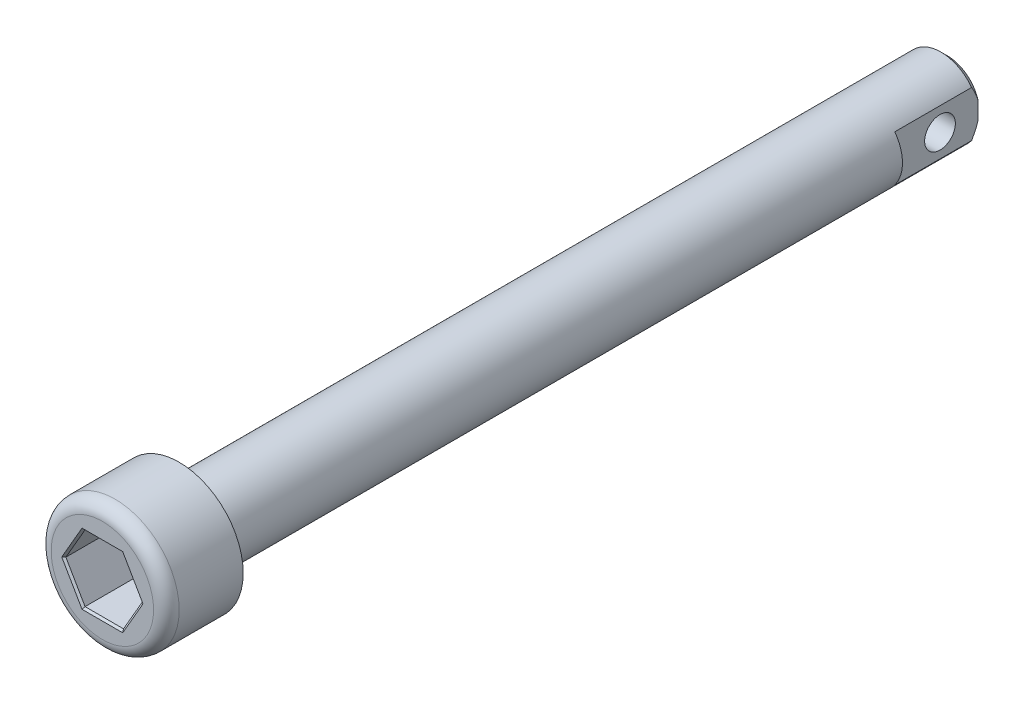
ISO-10303-21;
HEADER;
FILE_DESCRIPTION(('STEP AP214'),'2;1');
FILE_NAME('part.step','',(''),(''),'','','');
FILE_SCHEMA(('AUTOMOTIVE_DESIGN { 1 0 10303 214 1 1 1 1 }'));
ENDSEC;
DATA;
#1=APPLICATION_CONTEXT('core data for automotive mechanical design processes');
#2=APPLICATION_PROTOCOL_DEFINITION('international standard','automotive_design',2000,#1);
#3=PRODUCT_CONTEXT('',#1,'mechanical');
#4=PRODUCT('Part','Part','',(#3));
#5=PRODUCT_RELATED_PRODUCT_CATEGORY('part','',(#4));
#6=PRODUCT_DEFINITION_FORMATION('','',#4);
#7=PRODUCT_DEFINITION_CONTEXT('part definition',#1,'design');
#8=PRODUCT_DEFINITION('design','',#6,#7);
#9=PRODUCT_DEFINITION_SHAPE('','',#8);
#10=(LENGTH_UNIT() NAMED_UNIT(*) SI_UNIT(.MILLI.,.METRE.));
#11=(NAMED_UNIT(*) PLANE_ANGLE_UNIT() SI_UNIT($,.RADIAN.));
#12=(NAMED_UNIT(*) SI_UNIT($,.STERADIAN.) SOLID_ANGLE_UNIT());
#13=UNCERTAINTY_MEASURE_WITH_UNIT(LENGTH_MEASURE(1.E-05),#10,'distance_accuracy_value','');
#14=(GEOMETRIC_REPRESENTATION_CONTEXT(3) GLOBAL_UNCERTAINTY_ASSIGNED_CONTEXT((#13)) GLOBAL_UNIT_ASSIGNED_CONTEXT((#10,
#11,#12)) REPRESENTATION_CONTEXT('',''));
#15=CARTESIAN_POINT('',(0.,0.,0.));
#16=DIRECTION('',(0.,0.,1.));
#17=DIRECTION('',(1.,0.,0.));
#18=AXIS2_PLACEMENT_3D('',#15,#16,#17);
#19=CARTESIAN_POINT('',(0.,0.,-60.));
#20=DIRECTION('',(0.,0.,1.));
#21=DIRECTION('',(1.,0.,0.));
#22=AXIS2_PLACEMENT_3D('',#19,#20,#21);
#23=CONICAL_SURFACE('',#22,2.49999999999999,0.785398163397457);
#24=CARTESIAN_POINT('',(-2.4,-4.86411981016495,-57.0760105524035));
#25=CARTESIAN_POINT('',(-2.4,-4.75343904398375,-57.1752525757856));
#26=CARTESIAN_POINT('',(-2.4,-4.64244060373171,-57.2741434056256));
#27=CARTESIAN_POINT('',(-2.4,-4.41964149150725,-57.471036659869));
#28=CARTESIAN_POINT('',(-2.4,-4.30784074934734,-57.5690390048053));
#29=CARTESIAN_POINT('',(-2.4,-4.08288344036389,-57.7643042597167));
#30=CARTESIAN_POINT('',(-2.4,-3.96972343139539,-57.8615632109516));
#31=CARTESIAN_POINT('',(-2.4,-3.74223523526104,-58.0546982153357));
#32=CARTESIAN_POINT('',(-2.4,-3.6279070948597,-58.1505743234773));
#33=CARTESIAN_POINT('',(-2.4,-3.39101040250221,-58.346179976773));
#34=CARTESIAN_POINT('',(-2.4,-3.26835369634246,-58.4458030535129));
#35=CARTESIAN_POINT('',(-2.4,-3.02097816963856,-58.6424528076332));
#36=CARTESIAN_POINT('',(-2.4,-2.89625945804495,-58.739479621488));
#37=CARTESIAN_POINT('',(-2.4,-2.64434021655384,-58.9298829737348));
#38=CARTESIAN_POINT('',(-2.4,-2.51714357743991,-59.0232646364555));
#39=CARTESIAN_POINT('',(-2.4,-2.25931597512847,-59.205135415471));
#40=CARTESIAN_POINT('',(-2.4,-2.12868602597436,-59.2936259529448));
#41=CARTESIAN_POINT('',(-2.4,-1.89767283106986,-59.4413252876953));
#42=CARTESIAN_POINT('',(-2.4,-1.79831993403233,-59.5021369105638));
#43=CARTESIAN_POINT('',(-2.4,-1.59657013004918,-59.6186387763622));
#44=CARTESIAN_POINT('',(-2.4,-1.4941720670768,-59.6743270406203));
#45=CARTESIAN_POINT('',(-2.4,-1.28681517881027,-59.7782510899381));
#46=CARTESIAN_POINT('',(-2.4,-1.18188921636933,-59.8265516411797));
#47=CARTESIAN_POINT('',(-2.4,-0.96824334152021,-59.9138789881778));
#48=CARTESIAN_POINT('',(-2.4,-0.859526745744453,-59.9529136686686));
#49=CARTESIAN_POINT('',(-2.4,-0.678713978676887,-60.0067783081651));
#50=CARTESIAN_POINT('',(-2.4,-0.607702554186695,-60.0252458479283));
#51=CARTESIAN_POINT('',(-2.4,-0.464445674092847,-60.056471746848));
#52=CARTESIAN_POINT('',(-2.4,-0.392200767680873,-60.0692325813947));
#53=CARTESIAN_POINT('',(-2.4,-0.246990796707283,-60.0883954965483));
#54=CARTESIAN_POINT('',(-2.4,-0.174027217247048,-60.0948086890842));
#55=CARTESIAN_POINT('',(-2.4,-0.0278417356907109,-60.1009482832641));
#56=CARTESIAN_POINT('',(-2.4,0.0453800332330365,-60.1006777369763));
#57=CARTESIAN_POINT('',(-2.4,0.169562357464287,-60.0945613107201));
#58=CARTESIAN_POINT('',(-2.4,0.22061363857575,-60.090411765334));
#59=CARTESIAN_POINT('',(-2.4,0.322299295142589,-60.0789822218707));
#60=CARTESIAN_POINT('',(-2.4,0.372934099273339,-60.0717060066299));
#61=CARTESIAN_POINT('',(-2.4,0.510938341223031,-60.0477310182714));
#62=CARTESIAN_POINT('',(-2.4,0.597797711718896,-60.0280428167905));
#63=CARTESIAN_POINT('',(-2.4,0.769435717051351,-59.981032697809));
#64=CARTESIAN_POINT('',(-2.4,0.854212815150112,-59.9537053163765));
#65=CARTESIAN_POINT('',(-2.4,1.02248534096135,-59.8924616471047));
#66=CARTESIAN_POINT('',(-2.4,1.10595291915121,-59.8584697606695));
#67=CARTESIAN_POINT('',(-2.4,1.27057070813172,-59.78542488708));
#68=CARTESIAN_POINT('',(-2.4,1.35172188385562,-59.7463740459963));
#69=CARTESIAN_POINT('',(-2.4,1.5778510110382,-59.6305367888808));
#70=CARTESIAN_POINT('',(-2.4,1.72044850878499,-59.5491228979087));
#71=CARTESIAN_POINT('',(-2.4,2.00036407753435,-59.3776204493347));
#72=CARTESIAN_POINT('',(-2.4,2.13767732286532,-59.2875242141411));
#73=CARTESIAN_POINT('',(-2.4,2.40882965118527,-59.1010670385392));
#74=CARTESIAN_POINT('',(-2.4,2.54265111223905,-59.0046806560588));
#75=CARTESIAN_POINT('',(-2.4,2.80714311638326,-58.8078094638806));
#76=CARTESIAN_POINT('',(-2.4,2.93781480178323,-58.7073261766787));
#77=CARTESIAN_POINT('',(-2.4,3.18648942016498,-58.5114747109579));
#78=CARTESIAN_POINT('',(-2.4,3.30467335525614,-58.4163353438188));
#79=CARTESIAN_POINT('',(-2.4,3.5394626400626,-58.2241073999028));
#80=CARTESIAN_POINT('',(-2.4,3.65606781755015,-58.1270186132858));
#81=CARTESIAN_POINT('',(-2.4,3.88690049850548,-57.9322671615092));
#82=CARTESIAN_POINT('',(-2.4,4.00114006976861,-57.8346187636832));
#83=CARTESIAN_POINT('',(-2.4,4.22856848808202,-57.6381516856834));
#84=CARTESIAN_POINT('',(-2.4,4.34175754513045,-57.5393332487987));
#85=CARTESIAN_POINT('',(-2.4,4.45454390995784,-57.4400630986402));
#86=B_SPLINE_CURVE_WITH_KNOTS('',3,(#24,#25,#26,#27,#28,#29,#30,#31,#32,#33,#34,#35,#36,#37,#38,
#39,#40,#41,#42,#43,#44,#45,#46,#47,#48,#49,#50,#51,#52,#53,#54,#55,#56,#57,#58,#59,#60,#61,#62,
#63,#64,#65,#66,#67,#68,#69,#70,#71,#72,#73,#74,#75,#76,#77,#78,#79,#80,#81,#82,#83,#84,#85),
.UNSPECIFIED.,.F.,.F.,(4,2,2,2,2,2,2,2,2,2,2,2,2,2,2,2,2,2,2,2,2,2,2,2,2,2,2,2,2,2,4),(0.,
0.445976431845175,0.891992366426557,1.3396221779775,1.78723413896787,2.26125979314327,
2.73526048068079,3.20856888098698,3.68173902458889,4.03108709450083,4.38056952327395,
4.72678680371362,5.07270840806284,5.29263270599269,5.51246151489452,5.73190481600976,
5.95124791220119,6.10481157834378,6.25818997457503,6.52493203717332,6.79186537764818,
7.06202293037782,7.33206625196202,7.82413760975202,8.31664815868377,8.8112917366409,
9.30575314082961,9.76088743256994,10.2160709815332,10.6669202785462,11.1176774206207),.UNSPECIFIED.);
#87=CARTESIAN_POINT('',(-2.4,1.8,-59.5));
#88=VERTEX_POINT('',#87);
#89=CARTESIAN_POINT('',(-2.4,0.699999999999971,-60.));
#90=VERTEX_POINT('',#89);
#91=EDGE_CURVE('E43',#88,#90,#86,.F.);
#92=ORIENTED_EDGE('',*,*,#91,.F.);
#93=CARTESIAN_POINT('',(0.,0.,-59.5));
#94=DIRECTION('',(0.,0.,-1.));
#95=DIRECTION('',(-1.,0.,0.));
#96=AXIS2_PLACEMENT_3D('',#93,#94,#95);
#97=CIRCLE('',#96,3.);
#98=CARTESIAN_POINT('',(2.4,1.80000000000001,-59.5));
#99=VERTEX_POINT('',#98);
#100=EDGE_CURVE('E166',#99,#88,#97,.F.);
#101=ORIENTED_EDGE('',*,*,#100,.F.);
#102=CARTESIAN_POINT('',(2.4,-0.182917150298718,-60.0930395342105));
#103=CARTESIAN_POINT('',(2.4,-0.121580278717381,-60.0977356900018));
#104=CARTESIAN_POINT('',(2.4,-0.0600648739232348,-60.1000460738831));
#105=CARTESIAN_POINT('',(2.4,0.0629060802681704,-60.0999530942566));
#106=CARTESIAN_POINT('',(2.4,0.124361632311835,-60.0975540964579));
#107=CARTESIAN_POINT('',(2.4,0.245776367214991,-60.0881960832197));
#108=CARTESIAN_POINT('',(2.4,0.305742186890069,-60.0813223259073));
#109=CARTESIAN_POINT('',(2.4,0.42504602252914,-60.0633660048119));
#110=CARTESIAN_POINT('',(2.4,0.484383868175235,-60.0522823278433));
#111=CARTESIAN_POINT('',(2.4,0.636834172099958,-60.0186209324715));
#112=CARTESIAN_POINT('',(2.4,0.729305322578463,-59.9931161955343));
#113=CARTESIAN_POINT('',(2.4,0.9116651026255,-59.9341346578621));
#114=CARTESIAN_POINT('',(2.4,1.00155201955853,-59.9006527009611));
#115=CARTESIAN_POINT('',(2.4,1.1805826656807,-59.8266147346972));
#116=CARTESIAN_POINT('',(2.4,1.26966980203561,-59.7859232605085));
#117=CARTESIAN_POINT('',(2.4,1.40137466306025,-59.7210802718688));
#118=CARTESIAN_POINT('',(2.4,1.44494994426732,-59.6988346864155));
#119=CARTESIAN_POINT('',(2.4,1.5315068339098,-59.6532192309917));
#120=CARTESIAN_POINT('',(2.4,1.57448846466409,-59.6298494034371));
#121=CARTESIAN_POINT('',(2.4,1.70696166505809,-59.5558250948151));
#122=CARTESIAN_POINT('',(2.4,1.79551141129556,-59.503482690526));
#123=CARTESIAN_POINT('',(2.4,1.97054493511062,-59.3954370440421));
#124=CARTESIAN_POINT('',(2.4,2.05702820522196,-59.3397329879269));
#125=CARTESIAN_POINT('',(2.4,2.22831495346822,-59.2256601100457));
#126=CARTESIAN_POINT('',(2.4,2.3131169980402,-59.1672891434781));
#127=CARTESIAN_POINT('',(2.4,2.4812533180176,-59.0484653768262));
#128=CARTESIAN_POINT('',(2.4,2.56458747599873,-58.9880124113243));
#129=CARTESIAN_POINT('',(2.4,2.81339890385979,-58.8036916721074));
#130=CARTESIAN_POINT('',(2.4,2.97701703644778,-58.6773167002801));
#131=CARTESIAN_POINT('',(2.4,3.3007354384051,-58.4201409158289));
#132=CARTESIAN_POINT('',(2.4,3.46083523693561,-58.2893395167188));
#133=CARTESIAN_POINT('',(2.4,3.75988517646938,-58.0400956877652));
#134=CARTESIAN_POINT('',(2.4,3.89912085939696,-57.9219948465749));
#135=CARTESIAN_POINT('',(2.4,4.17603868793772,-57.6839537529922));
#136=CARTESIAN_POINT('',(2.4,4.31372062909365,-57.564013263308));
#137=CARTESIAN_POINT('',(2.4,4.5866136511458,-57.3238183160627));
#138=CARTESIAN_POINT('',(2.4,4.72183581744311,-57.2035764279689));
#139=CARTESIAN_POINT('',(2.4,4.99126824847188,-56.9620158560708));
#140=CARTESIAN_POINT('',(2.4,5.12547870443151,-56.8406973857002));
#141=CARTESIAN_POINT('',(2.4,5.2593102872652,-56.7189668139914));
#142=B_SPLINE_CURVE_WITH_KNOTS('',3,(#102,#103,#104,#105,#106,#107,#108,#109,#110,#111,#112,
#113,#114,#115,#116,#117,#118,#119,#120,#121,#122,#123,#124,#125,#126,#127,#128,#129,#130,#131,
#132,#133,#134,#135,#136,#137,#138,#139,#140,#141),.UNSPECIFIED.,.F.,.F.,(4,2,2,2,2,2,2,2,2,2,2,
2,2,2,2,2,2,2,2,4),(0.,0.184497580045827,0.368824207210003,0.549737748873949,0.730699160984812,
1.01799082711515,1.3054686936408,1.59906871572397,1.74583177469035,1.89258930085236,
2.20106970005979,2.50962509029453,2.81843315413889,3.12726581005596,3.74735341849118,
4.36752351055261,4.91523415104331,5.4630160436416,6.00586157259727,6.54860178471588),.UNSPECIFIED.);
#143=CARTESIAN_POINT('',(2.4,0.699999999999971,-60.));
#144=VERTEX_POINT('',#143);
#145=EDGE_CURVE('E156',#144,#99,#142,.T.);
#146=ORIENTED_EDGE('',*,*,#145,.F.);
#147=CARTESIAN_POINT('',(0.,0.,-60.));
#148=DIRECTION('',(0.,0.,-1.));
#149=DIRECTION('',(-1.,0.,0.));
#150=AXIS2_PLACEMENT_3D('',#147,#148,#149);
#151=CIRCLE('',#150,2.49999999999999);
#152=EDGE_CURVE('E57',#90,#144,#151,.T.);
#153=ORIENTED_EDGE('',*,*,#152,.F.);
#154=EDGE_LOOP('',(#92,#101,#146,#153));
#155=FACE_BOUND('',#154,.T.);
#156=ADVANCED_FACE('F34',(#155),#23,.T.);
#157=CARTESIAN_POINT('',(0.,0.,0.));
#158=DIRECTION('',(0.,0.,1.));
#159=DIRECTION('',(1.,0.,0.));
#160=AXIS2_PLACEMENT_3D('',#157,#158,#159);
#161=PLANE('',#160);
#162=CARTESIAN_POINT('',(0.,0.,0.));
#163=DIRECTION('',(0.,0.,1.));
#164=DIRECTION('',(1.,0.,0.));
#165=AXIS2_PLACEMENT_3D('',#162,#163,#164);
#166=CIRCLE('',#165,5.);
#167=CARTESIAN_POINT('',(5.,0.,0.));
#168=VERTEX_POINT('',#167);
#169=EDGE_CURVE('E287',#168,#168,#166,.T.);
#170=ORIENTED_EDGE('',*,*,#169,.F.);
#171=EDGE_LOOP('',(#170));
#172=FACE_BOUND('',#171,.T.);
#173=CARTESIAN_POINT('',(0.,0.,0.));
#174=DIRECTION('',(0.,0.,-1.));
#175=DIRECTION('',(-1.,0.,0.));
#176=AXIS2_PLACEMENT_3D('',#173,#174,#175);
#177=CIRCLE('',#176,3.);
#178=CARTESIAN_POINT('',(-3.,0.,0.));
#179=VERTEX_POINT('',#178);
#180=EDGE_CURVE('E157',#179,#179,#177,.T.);
#181=ORIENTED_EDGE('',*,*,#180,.F.);
#182=EDGE_LOOP('',(#181));
#183=FACE_BOUND('',#182,.T.);
#184=ADVANCED_FACE('F378',(#172,#183),#161,.F.);
#185=CARTESIAN_POINT('',(0.,0.,6.));
#186=DIRECTION('',(0.,0.,1.));
#187=DIRECTION('',(1.,0.,0.));
#188=AXIS2_PLACEMENT_3D('',#185,#186,#187);
#189=PLANE('',#188);
#190=DIRECTION('',(0.499554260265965,0.86628259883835,0.));
#191=VECTOR('',#190,1.);
#192=CARTESIAN_POINT('',(-2.38127901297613,1.3731986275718,6.));
#193=LINE('',#192,#191);
#194=CARTESIAN_POINT('',(-3.1731536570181,0.,6.));
#195=VERTEX_POINT('',#194);
#196=CARTESIAN_POINT('',(-1.58932725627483,2.74653097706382,6.));
#197=VERTEX_POINT('',#196);
#198=EDGE_CURVE('E296',#195,#197,#193,.T.);
#199=ORIENTED_EDGE('',*,*,#198,.T.);
#200=DIRECTION('',(1.,0.,0.));
#201=VECTOR('',#200,1.);
#202=CARTESIAN_POINT('',(0.,2.74653097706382,6.));
#203=LINE('',#202,#201);
#204=CARTESIAN_POINT('',(1.58932725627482,2.74653097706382,6.));
#205=VERTEX_POINT('',#204);
#206=EDGE_CURVE('E306',#197,#205,#203,.T.);
#207=ORIENTED_EDGE('',*,*,#206,.T.);
#208=DIRECTION('',(0.499554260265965,-0.86628259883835,0.));
#209=VECTOR('',#208,1.);
#210=CARTESIAN_POINT('',(2.38127901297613,1.3731986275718,6.));
#211=LINE('',#210,#209);
#212=CARTESIAN_POINT('',(3.1731536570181,0.,6.));
#213=VERTEX_POINT('',#212);
#214=EDGE_CURVE('E304',#205,#213,#211,.T.);
#215=ORIENTED_EDGE('',*,*,#214,.T.);
#216=DIRECTION('',(-0.499554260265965,-0.86628259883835,0.));
#217=VECTOR('',#216,1.);
#218=CARTESIAN_POINT('',(2.38127901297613,-1.3731986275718,6.));
#219=LINE('',#218,#217);
#220=CARTESIAN_POINT('',(1.58932725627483,-2.74653097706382,6.));
#221=VERTEX_POINT('',#220);
#222=EDGE_CURVE('E302',#213,#221,#219,.T.);
#223=ORIENTED_EDGE('',*,*,#222,.T.);
#224=DIRECTION('',(-1.,0.,0.));
#225=VECTOR('',#224,1.);
#226=CARTESIAN_POINT('',(0.,-2.74653097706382,6.));
#227=LINE('',#226,#225);
#228=CARTESIAN_POINT('',(-1.58932725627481,-2.74653097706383,6.));
#229=VERTEX_POINT('',#228);
#230=EDGE_CURVE('E300',#221,#229,#227,.T.);
#231=ORIENTED_EDGE('',*,*,#230,.T.);
#232=DIRECTION('',(-0.499554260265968,0.866282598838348,0.));
#233=VECTOR('',#232,1.);
#234=CARTESIAN_POINT('',(-2.38127901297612,-1.37319862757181,6.));
#235=LINE('',#234,#233);
#236=EDGE_CURVE('E298',#229,#195,#235,.T.);
#237=ORIENTED_EDGE('',*,*,#236,.T.);
#238=EDGE_LOOP('',(#199,#207,#215,#223,#231,#237));
#239=FACE_BOUND('',#238,.T.);
#240=CARTESIAN_POINT('',(0.,0.,6.));
#241=DIRECTION('',(0.,0.,1.));
#242=DIRECTION('',(1.,0.,0.));
#243=AXIS2_PLACEMENT_3D('',#240,#241,#242);
#244=CIRCLE('',#243,4.);
#245=CARTESIAN_POINT('',(4.,0.,6.));
#246=VERTEX_POINT('',#245);
#247=EDGE_CURVE('E290',#246,#246,#244,.T.);
#248=ORIENTED_EDGE('',*,*,#247,.T.);
#249=EDGE_LOOP('',(#248));
#250=FACE_BOUND('',#249,.T.);
#251=ADVANCED_FACE('F337',(#239,#250),#189,.T.);
#252=CARTESIAN_POINT('',(0.,0.,6.));
#253=DIRECTION('',(0.,0.,-1.));
#254=DIRECTION('',(-1.,0.,0.));
#255=AXIS2_PLACEMENT_3D('',#252,#253,#254);
#256=CYLINDRICAL_SURFACE('',#255,5.);
#257=CARTESIAN_POINT('',(0.,0.,5.));
#258=DIRECTION('',(0.,0.,1.));
#259=DIRECTION('',(1.,0.,0.));
#260=AXIS2_PLACEMENT_3D('',#257,#258,#259);
#261=CIRCLE('',#260,5.);
#262=CARTESIAN_POINT('',(5.,0.,5.));
#263=VERTEX_POINT('',#262);
#264=EDGE_CURVE('E293',#263,#263,#261,.F.);
#265=ORIENTED_EDGE('',*,*,#264,.T.);
#266=EDGE_LOOP('',(#265));
#267=FACE_BOUND('',#266,.T.);
#268=ORIENTED_EDGE('',*,*,#169,.T.);
#269=EDGE_LOOP('',(#268));
#270=FACE_BOUND('',#269,.T.);
#271=ADVANCED_FACE('F36',(#267,#270),#256,.T.);
#272=CARTESIAN_POINT('',(-1.50267324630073,-2.59653097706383,2.));
#273=DIRECTION('',(0.866282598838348,0.499554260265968,0.));
#274=DIRECTION('',(-0.499554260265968,0.866282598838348,0.));
#275=AXIS2_PLACEMENT_3D('',#272,#273,#274);
#276=PLANE('',#275);
#277=DIRECTION('',(0.,0.,1.));
#278=VECTOR('',#277,1.);
#279=CARTESIAN_POINT('',(-3.,0.,2.));
#280=LINE('',#279,#278);
#281=CARTESIAN_POINT('',(-3.,0.,2.));
#282=VERTEX_POINT('',#281);
#283=CARTESIAN_POINT('',(-3.,0.,5.85));
#284=VERTEX_POINT('',#283);
#285=EDGE_CURVE('E284',#282,#284,#280,.T.);
#286=ORIENTED_EDGE('',*,*,#285,.T.);
#287=DIRECTION('',(0.499554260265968,-0.866282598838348,0.));
#288=VECTOR('',#287,1.);
#289=CARTESIAN_POINT('',(-1.50267324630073,-2.59653097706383,5.85));
#290=LINE('',#289,#288);
#291=CARTESIAN_POINT('',(-1.50267324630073,-2.59653097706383,5.85));
#292=VERTEX_POINT('',#291);
#293=EDGE_CURVE('E317',#284,#292,#290,.T.);
#294=ORIENTED_EDGE('',*,*,#293,.T.);
#295=DIRECTION('',(0.,0.,1.));
#296=VECTOR('',#295,1.);
#297=CARTESIAN_POINT('',(-1.50267324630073,-2.59653097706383,2.));
#298=LINE('',#297,#296);
#299=CARTESIAN_POINT('',(-1.50267324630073,-2.59653097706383,2.));
#300=VERTEX_POINT('',#299);
#301=EDGE_CURVE('E269',#300,#292,#298,.T.);
#302=ORIENTED_EDGE('',*,*,#301,.F.);
#303=DIRECTION('',(-0.499554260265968,0.866282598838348,0.));
#304=VECTOR('',#303,1.);
#305=CARTESIAN_POINT('',(-1.50267324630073,-2.59653097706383,2.));
#306=LINE('',#305,#304);
#307=EDGE_CURVE('E251',#300,#282,#306,.T.);
#308=ORIENTED_EDGE('',*,*,#307,.T.);
#309=EDGE_LOOP('',(#286,#294,#302,#308));
#310=FACE_BOUND('',#309,.T.);
#311=ADVANCED_FACE('F325',(#310),#276,.T.);
#312=CARTESIAN_POINT('',(-3.,0.,2.));
#313=DIRECTION('',(0.86628259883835,-0.499554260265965,0.));
#314=DIRECTION('',(0.499554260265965,0.86628259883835,0.));
#315=AXIS2_PLACEMENT_3D('',#312,#313,#314);
#316=PLANE('',#315);
#317=DIRECTION('',(0.,0.,1.));
#318=VECTOR('',#317,1.);
#319=CARTESIAN_POINT('',(-1.50267324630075,2.59653097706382,2.));
#320=LINE('',#319,#318);
#321=CARTESIAN_POINT('',(-1.50267324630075,2.59653097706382,2.));
#322=VERTEX_POINT('',#321);
#323=CARTESIAN_POINT('',(-1.50267324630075,2.59653097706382,5.85));
#324=VERTEX_POINT('',#323);
#325=EDGE_CURVE('E281',#322,#324,#320,.T.);
#326=ORIENTED_EDGE('',*,*,#325,.T.);
#327=DIRECTION('',(-0.499554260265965,-0.86628259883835,0.));
#328=VECTOR('',#327,1.);
#329=CARTESIAN_POINT('',(-3.,0.,5.85));
#330=LINE('',#329,#328);
#331=EDGE_CURVE('E161',#324,#284,#330,.T.);
#332=ORIENTED_EDGE('',*,*,#331,.T.);
#333=ORIENTED_EDGE('',*,*,#285,.F.);
#334=DIRECTION('',(0.499554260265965,0.86628259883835,0.));
#335=VECTOR('',#334,1.);
#336=CARTESIAN_POINT('',(-3.,0.,2.));
#337=LINE('',#336,#335);
#338=EDGE_CURVE('E254',#282,#322,#337,.T.);
#339=ORIENTED_EDGE('',*,*,#338,.T.);
#340=EDGE_LOOP('',(#326,#332,#333,#339));
#341=FACE_BOUND('',#340,.T.);
#342=ADVANCED_FACE('F322',(#341),#316,.T.);
#343=CARTESIAN_POINT('',(-1.50267324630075,2.59653097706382,2.));
#344=DIRECTION('',(0.,-1.,0.));
#345=DIRECTION('',(0.,0.,-1.));
#346=AXIS2_PLACEMENT_3D('',#343,#344,#345);
#347=PLANE('',#346);
#348=DIRECTION('',(0.,0.,1.));
#349=VECTOR('',#348,1.);
#350=CARTESIAN_POINT('',(1.50267324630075,2.59653097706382,2.));
#351=LINE('',#350,#349);
#352=CARTESIAN_POINT('',(1.50267324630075,2.59653097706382,2.));
#353=VERTEX_POINT('',#352);
#354=CARTESIAN_POINT('',(1.50267324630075,2.59653097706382,5.85));
#355=VERTEX_POINT('',#354);
#356=EDGE_CURVE('E278',#353,#355,#351,.T.);
#357=ORIENTED_EDGE('',*,*,#356,.T.);
#358=DIRECTION('',(-1.,0.,0.));
#359=VECTOR('',#358,1.);
#360=CARTESIAN_POINT('',(-1.50267324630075,2.59653097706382,5.85));
#361=LINE('',#360,#359);
#362=EDGE_CURVE('E309',#355,#324,#361,.T.);
#363=ORIENTED_EDGE('',*,*,#362,.T.);
#364=ORIENTED_EDGE('',*,*,#325,.F.);
#365=DIRECTION('',(1.,0.,0.));
#366=VECTOR('',#365,1.);
#367=CARTESIAN_POINT('',(-1.50267324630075,2.59653097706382,2.));
#368=LINE('',#367,#366);
#369=EDGE_CURVE('E257',#322,#353,#368,.T.);
#370=ORIENTED_EDGE('',*,*,#369,.T.);
#371=EDGE_LOOP('',(#357,#363,#364,#370));
#372=FACE_BOUND('',#371,.T.);
#373=ADVANCED_FACE('F357',(#372),#347,.T.);
#374=CARTESIAN_POINT('',(1.50267324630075,2.59653097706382,2.));
#375=DIRECTION('',(-0.86628259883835,-0.499554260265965,0.));
#376=DIRECTION('',(0.499554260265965,-0.86628259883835,0.));
#377=AXIS2_PLACEMENT_3D('',#374,#375,#376);
#378=PLANE('',#377);
#379=DIRECTION('',(0.,0.,1.));
#380=VECTOR('',#379,1.);
#381=CARTESIAN_POINT('',(3.,0.,2.));
#382=LINE('',#381,#380);
#383=CARTESIAN_POINT('',(3.,0.,2.));
#384=VERTEX_POINT('',#383);
#385=CARTESIAN_POINT('',(3.,0.,5.85));
#386=VERTEX_POINT('',#385);
#387=EDGE_CURVE('E275',#384,#386,#382,.T.);
#388=ORIENTED_EDGE('',*,*,#387,.T.);
#389=DIRECTION('',(-0.499554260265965,0.86628259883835,0.));
#390=VECTOR('',#389,1.);
#391=CARTESIAN_POINT('',(1.50267324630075,2.59653097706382,5.85));
#392=LINE('',#391,#390);
#393=EDGE_CURVE('E312',#386,#355,#392,.T.);
#394=ORIENTED_EDGE('',*,*,#393,.T.);
#395=ORIENTED_EDGE('',*,*,#356,.F.);
#396=DIRECTION('',(0.499554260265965,-0.86628259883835,0.));
#397=VECTOR('',#396,1.);
#398=CARTESIAN_POINT('',(1.50267324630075,2.59653097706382,2.));
#399=LINE('',#398,#397);
#400=EDGE_CURVE('E260',#353,#384,#399,.T.);
#401=ORIENTED_EDGE('',*,*,#400,.T.);
#402=EDGE_LOOP('',(#388,#394,#395,#401));
#403=FACE_BOUND('',#402,.T.);
#404=ADVANCED_FACE('F509',(#403),#378,.T.);
#405=CARTESIAN_POINT('',(3.,0.,2.));
#406=DIRECTION('',(-0.86628259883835,0.499554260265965,0.));
#407=DIRECTION('',(-0.499554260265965,-0.86628259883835,0.));
#408=AXIS2_PLACEMENT_3D('',#405,#406,#407);
#409=PLANE('',#408);
#410=DIRECTION('',(0.,0.,1.));
#411=VECTOR('',#410,1.);
#412=CARTESIAN_POINT('',(1.50267324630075,-2.59653097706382,2.));
#413=LINE('',#412,#411);
#414=CARTESIAN_POINT('',(1.50267324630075,-2.59653097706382,2.));
#415=VERTEX_POINT('',#414);
#416=CARTESIAN_POINT('',(1.50267324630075,-2.59653097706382,5.85));
#417=VERTEX_POINT('',#416);
#418=EDGE_CURVE('E272',#415,#417,#413,.T.);
#419=ORIENTED_EDGE('',*,*,#418,.T.);
#420=DIRECTION('',(0.499554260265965,0.86628259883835,0.));
#421=VECTOR('',#420,1.);
#422=CARTESIAN_POINT('',(3.,0.,5.85));
#423=LINE('',#422,#421);
#424=EDGE_CURVE('E314',#417,#386,#423,.T.);
#425=ORIENTED_EDGE('',*,*,#424,.T.);
#426=ORIENTED_EDGE('',*,*,#387,.F.);
#427=DIRECTION('',(-0.499554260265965,-0.86628259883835,0.));
#428=VECTOR('',#427,1.);
#429=CARTESIAN_POINT('',(3.,0.,2.));
#430=LINE('',#429,#428);
#431=EDGE_CURVE('E263',#384,#415,#430,.T.);
#432=ORIENTED_EDGE('',*,*,#431,.T.);
#433=EDGE_LOOP('',(#419,#425,#426,#432));
#434=FACE_BOUND('',#433,.T.);
#435=ADVANCED_FACE('F349',(#434),#409,.T.);
#436=CARTESIAN_POINT('',(1.50267324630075,-2.59653097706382,2.));
#437=DIRECTION('',(0.,1.,0.));
#438=DIRECTION('',(-1.,0.,0.));
#439=AXIS2_PLACEMENT_3D('',#436,#437,#438);
#440=PLANE('',#439);
#441=ORIENTED_EDGE('',*,*,#301,.T.);
#442=DIRECTION('',(1.,0.,0.));
#443=VECTOR('',#442,1.);
#444=CARTESIAN_POINT('',(1.50267324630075,-2.59653097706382,5.85));
#445=LINE('',#444,#443);
#446=EDGE_CURVE('E316',#292,#417,#445,.T.);
#447=ORIENTED_EDGE('',*,*,#446,.T.);
#448=ORIENTED_EDGE('',*,*,#418,.F.);
#449=DIRECTION('',(-1.,0.,0.));
#450=VECTOR('',#449,1.);
#451=CARTESIAN_POINT('',(1.50267324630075,-2.59653097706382,2.));
#452=LINE('',#451,#450);
#453=EDGE_CURVE('E266',#415,#300,#452,.T.);
#454=ORIENTED_EDGE('',*,*,#453,.T.);
#455=EDGE_LOOP('',(#441,#447,#448,#454));
#456=FACE_BOUND('',#455,.T.);
#457=ADVANCED_FACE('F347',(#456),#440,.T.);
#458=CARTESIAN_POINT('',(-1.50267324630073,-2.59653097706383,2.));
#459=DIRECTION('',(0.,0.,1.));
#460=DIRECTION('',(1.,0.,0.));
#461=AXIS2_PLACEMENT_3D('',#458,#459,#460);
#462=PLANE('',#461);
#463=ORIENTED_EDGE('',*,*,#307,.F.);
#464=ORIENTED_EDGE('',*,*,#453,.F.);
#465=ORIENTED_EDGE('',*,*,#431,.F.);
#466=ORIENTED_EDGE('',*,*,#400,.F.);
#467=ORIENTED_EDGE('',*,*,#369,.F.);
#468=ORIENTED_EDGE('',*,*,#338,.F.);
#469=EDGE_LOOP('',(#463,#464,#465,#466,#467,#468));
#470=FACE_BOUND('',#469,.T.);
#471=ADVANCED_FACE('F354',(#470),#462,.T.);
#472=CARTESIAN_POINT('',(0.,0.,5.));
#473=DIRECTION('',(0.,0.,1.));
#474=DIRECTION('',(1.,0.,0.));
#475=AXIS2_PLACEMENT_3D('',#472,#473,#474);
#476=TOROIDAL_SURFACE('',#475,4.,1.);
#477=ORIENTED_EDGE('',*,*,#264,.F.);
#478=EDGE_LOOP('',(#477));
#479=FACE_BOUND('',#478,.T.);
#480=ORIENTED_EDGE('',*,*,#247,.F.);
#481=EDGE_LOOP('',(#480));
#482=FACE_BOUND('',#481,.T.);
#483=ADVANCED_FACE('F536',(#479,#482),#476,.T.);
#484=CARTESIAN_POINT('',(0.,-2.74653097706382,6.));
#485=DIRECTION('',(0.,-0.707106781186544,-0.707106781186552));
#486=DIRECTION('',(0.,0.707106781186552,-0.707106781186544));
#487=AXIS2_PLACEMENT_3D('',#484,#485,#486);
#488=PLANE('',#487);
#489=DIRECTION('',(-0.378156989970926,0.654598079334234,-0.654598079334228));
#490=VECTOR('',#489,1.);
#491=CARTESIAN_POINT('',(1.36262266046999,-2.35410032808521,5.6075693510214));
#492=LINE('',#491,#490);
#493=EDGE_CURVE('E245',#417,#221,#492,.F.);
#494=ORIENTED_EDGE('',*,*,#493,.F.);
#495=ORIENTED_EDGE('',*,*,#446,.F.);
#496=DIRECTION('',(0.378156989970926,0.654598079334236,-0.654598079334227));
#497=VECTOR('',#496,1.);
#498=CARTESIAN_POINT('',(-1.36204915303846,-2.35310757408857,5.60657659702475));
#499=LINE('',#498,#497);
#500=EDGE_CURVE('E248',#229,#292,#499,.T.);
#501=ORIENTED_EDGE('',*,*,#500,.F.);
#502=ORIENTED_EDGE('',*,*,#230,.F.);
#503=EDGE_LOOP('',(#494,#495,#501,#502));
#504=FACE_BOUND('',#503,.T.);
#505=ADVANCED_FACE('F344',(#504),#488,.F.);
#506=CARTESIAN_POINT('',(-2.38127901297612,-1.37319862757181,6.));
#507=DIRECTION('',(-0.612554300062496,-0.353238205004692,-0.707106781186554));
#508=DIRECTION('',(-0.75583273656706,0.,0.654764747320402));
#509=AXIS2_PLACEMENT_3D('',#506,#507,#508);
#510=PLANE('',#509);
#511=ORIENTED_EDGE('',*,*,#500,.T.);
#512=ORIENTED_EDGE('',*,*,#293,.F.);
#513=DIRECTION('',(0.755832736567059,0.,-0.654764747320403));
#514=VECTOR('',#513,1.);
#515=CARTESIAN_POINT('',(-2.7207690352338,0.,5.6081070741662));
#516=LINE('',#515,#514);
#517=EDGE_CURVE('E242',#195,#284,#516,.T.);
#518=ORIENTED_EDGE('',*,*,#517,.F.);
#519=ORIENTED_EDGE('',*,*,#236,.F.);
#520=EDGE_LOOP('',(#511,#512,#518,#519));
#521=FACE_BOUND('',#520,.T.);
#522=ADVANCED_FACE('F330',(#521),#510,.F.);
#523=CARTESIAN_POINT('',(2.38127901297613,-1.3731986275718,6.));
#524=DIRECTION('',(0.612554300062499,-0.353238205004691,-0.707106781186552));
#525=DIRECTION('',(-0.755832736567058,0.,-0.654764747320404));
#526=AXIS2_PLACEMENT_3D('',#523,#524,#525);
#527=PLANE('',#526);
#528=ORIENTED_EDGE('',*,*,#493,.T.);
#529=ORIENTED_EDGE('',*,*,#222,.F.);
#530=DIRECTION('',(-0.755832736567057,0.,-0.654764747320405));
#531=VECTOR('',#530,1.);
#532=CARTESIAN_POINT('',(2.7207690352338,0.,5.6081070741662));
#533=LINE('',#532,#531);
#534=EDGE_CURVE('E239',#386,#213,#533,.F.);
#535=ORIENTED_EDGE('',*,*,#534,.F.);
#536=ORIENTED_EDGE('',*,*,#424,.F.);
#537=EDGE_LOOP('',(#528,#529,#535,#536));
#538=FACE_BOUND('',#537,.T.);
#539=ADVANCED_FACE('F368',(#538),#527,.F.);
#540=CARTESIAN_POINT('',(-2.38127901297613,1.3731986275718,6.));
#541=DIRECTION('',(-0.612554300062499,0.353238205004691,-0.707106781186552));
#542=DIRECTION('',(-0.755832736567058,0.,0.654764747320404));
#543=AXIS2_PLACEMENT_3D('',#540,#541,#542);
#544=PLANE('',#543);
#545=ORIENTED_EDGE('',*,*,#517,.T.);
#546=ORIENTED_EDGE('',*,*,#331,.F.);
#547=DIRECTION('',(-0.378156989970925,0.654598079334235,0.654598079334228));
#548=VECTOR('',#547,1.);
#549=CARTESIAN_POINT('',(-1.36204915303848,2.35310757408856,5.60657659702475));
#550=LINE('',#549,#548);
#551=EDGE_CURVE('E237',#197,#324,#550,.F.);
#552=ORIENTED_EDGE('',*,*,#551,.F.);
#553=ORIENTED_EDGE('',*,*,#198,.F.);
#554=EDGE_LOOP('',(#545,#546,#552,#553));
#555=FACE_BOUND('',#554,.T.);
#556=ADVANCED_FACE('F334',(#555),#544,.F.);
#557=CARTESIAN_POINT('',(2.38127901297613,1.3731986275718,6.));
#558=DIRECTION('',(0.6125543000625,0.353238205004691,-0.707106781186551));
#559=DIRECTION('',(-0.755832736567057,0.,-0.654764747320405));
#560=AXIS2_PLACEMENT_3D('',#557,#558,#559);
#561=PLANE('',#560);
#562=ORIENTED_EDGE('',*,*,#534,.T.);
#563=ORIENTED_EDGE('',*,*,#214,.F.);
#564=DIRECTION('',(-0.378156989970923,-0.654598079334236,-0.654598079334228));
#565=VECTOR('',#564,1.);
#566=CARTESIAN_POINT('',(1.36204915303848,2.35310757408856,5.60657659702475));
#567=LINE('',#566,#565);
#568=EDGE_CURVE('E234',#355,#205,#567,.F.);
#569=ORIENTED_EDGE('',*,*,#568,.F.);
#570=ORIENTED_EDGE('',*,*,#393,.F.);
#571=EDGE_LOOP('',(#562,#563,#569,#570));
#572=FACE_BOUND('',#571,.T.);
#573=ADVANCED_FACE('F365',(#572),#561,.F.);
#574=CARTESIAN_POINT('',(0.,2.74653097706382,6.));
#575=DIRECTION('',(0.,0.707106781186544,-0.707106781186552));
#576=DIRECTION('',(0.,0.707106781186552,0.707106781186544));
#577=AXIS2_PLACEMENT_3D('',#574,#575,#576);
#578=PLANE('',#577);
#579=ORIENTED_EDGE('',*,*,#551,.T.);
#580=ORIENTED_EDGE('',*,*,#362,.F.);
#581=ORIENTED_EDGE('',*,*,#568,.T.);
#582=ORIENTED_EDGE('',*,*,#206,.F.);
#583=EDGE_LOOP('',(#579,#580,#581,#582));
#584=FACE_BOUND('',#583,.T.);
#585=ADVANCED_FACE('F361',(#584),#578,.F.);
#586=CARTESIAN_POINT('',(0.,0.,-60.));
#587=DIRECTION('',(0.,0.,1.));
#588=DIRECTION('',(1.,0.,0.));
#589=AXIS2_PLACEMENT_3D('',#586,#587,#588);
#590=CYLINDRICAL_SURFACE('',#589,3.);
#591=ORIENTED_EDGE('',*,*,#100,.T.);
#592=DIRECTION('',(0.,0.,1.));
#593=VECTOR('',#592,1.);
#594=CARTESIAN_POINT('',(-2.4,1.8,-60.));
#595=LINE('',#594,#593);
#596=CARTESIAN_POINT('',(-2.4,1.8,-53.5));
#597=VERTEX_POINT('',#596);
#598=EDGE_CURVE('E143',#88,#597,#595,.T.);
#599=ORIENTED_EDGE('',*,*,#598,.T.);
#600=CARTESIAN_POINT('',(0.,0.,-53.5));
#601=DIRECTION('',(0.,0.,-1.));
#602=DIRECTION('',(-1.,0.,0.));
#603=AXIS2_PLACEMENT_3D('',#600,#601,#602);
#604=CIRCLE('',#603,3.);
#605=CARTESIAN_POINT('',(-2.4,-1.8,-53.5));
#606=VERTEX_POINT('',#605);
#607=EDGE_CURVE('E11',#606,#597,#604,.T.);
#608=ORIENTED_EDGE('',*,*,#607,.F.);
#609=DIRECTION('',(0.,0.,1.));
#610=VECTOR('',#609,1.);
#611=CARTESIAN_POINT('',(-2.4,-1.8,-60.));
#612=LINE('',#611,#610);
#613=CARTESIAN_POINT('',(-2.4,-1.80000000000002,-59.5));
#614=VERTEX_POINT('',#613);
#615=EDGE_CURVE('E221',#606,#614,#612,.F.);
#616=ORIENTED_EDGE('',*,*,#615,.T.);
#617=CARTESIAN_POINT('',(2.4,-1.8,-59.5));
#618=VERTEX_POINT('',#617);
#619=EDGE_CURVE('E159',#614,#618,#97,.F.);
#620=ORIENTED_EDGE('',*,*,#619,.T.);
#621=DIRECTION('',(0.,0.,1.));
#622=VECTOR('',#621,1.);
#623=CARTESIAN_POINT('',(2.4,-1.8,-60.));
#624=LINE('',#623,#622);
#625=CARTESIAN_POINT('',(2.4,-1.8,-53.5));
#626=VERTEX_POINT('',#625);
#627=EDGE_CURVE('E215',#618,#626,#624,.T.);
#628=ORIENTED_EDGE('',*,*,#627,.T.);
#629=CARTESIAN_POINT('',(0.,0.,-53.5));
#630=DIRECTION('',(0.,0.,1.));
#631=DIRECTION('',(1.,0.,0.));
#632=AXIS2_PLACEMENT_3D('',#629,#630,#631);
#633=CIRCLE('',#632,3.);
#634=CARTESIAN_POINT('',(2.4,1.8,-53.5));
#635=VERTEX_POINT('',#634);
#636=EDGE_CURVE('E205',#626,#635,#633,.T.);
#637=ORIENTED_EDGE('',*,*,#636,.T.);
#638=DIRECTION('',(0.,0.,1.));
#639=VECTOR('',#638,1.);
#640=CARTESIAN_POINT('',(2.4,1.8,-60.));
#641=LINE('',#640,#639);
#642=EDGE_CURVE('E232',#635,#99,#641,.F.);
#643=ORIENTED_EDGE('',*,*,#642,.T.);
#644=EDGE_LOOP('',(#591,#599,#608,#616,#620,#628,#637,#643));
#645=FACE_BOUND('',#644,.T.);
#646=ORIENTED_EDGE('',*,*,#180,.T.);
#647=EDGE_LOOP('',(#646));
#648=FACE_BOUND('',#647,.T.);
#649=ADVANCED_FACE('F224',(#645,#648),#590,.T.);
#650=CARTESIAN_POINT('',(0.,0.,-60.));
#651=DIRECTION('',(0.,0.,-1.));
#652=DIRECTION('',(-1.,0.,0.));
#653=AXIS2_PLACEMENT_3D('',#650,#651,#652);
#654=PLANE('',#653);
#655=DIRECTION('',(0.,-1.,0.));
#656=VECTOR('',#655,1.);
#657=CARTESIAN_POINT('',(-2.4,3.,-60.));
#658=LINE('',#657,#656);
#659=CARTESIAN_POINT('',(-2.4,-0.699999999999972,-60.));
#660=VERTEX_POINT('',#659);
#661=EDGE_CURVE('E50',#90,#660,#658,.T.);
#662=ORIENTED_EDGE('',*,*,#661,.F.);
#663=ORIENTED_EDGE('',*,*,#152,.T.);
#664=DIRECTION('',(0.,1.,0.));
#665=VECTOR('',#664,1.);
#666=CARTESIAN_POINT('',(2.4,-2.74653097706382,-60.));
#667=LINE('',#666,#665);
#668=CARTESIAN_POINT('',(2.4,-0.699999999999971,-60.));
#669=VERTEX_POINT('',#668);
#670=EDGE_CURVE('E213',#669,#144,#667,.T.);
#671=ORIENTED_EDGE('',*,*,#670,.F.);
#672=EDGE_CURVE('E152',#669,#660,#151,.T.);
#673=ORIENTED_EDGE('',*,*,#672,.T.);
#674=EDGE_LOOP('',(#662,#663,#671,#673));
#675=FACE_BOUND('',#674,.T.);
#676=ADVANCED_FACE('F150',(#675),#654,.T.);
#677=EDGE_CURVE('E147',#660,#614,#86,.F.);
#678=ORIENTED_EDGE('',*,*,#677,.F.);
#679=ORIENTED_EDGE('',*,*,#672,.F.);
#680=CARTESIAN_POINT('',(2.4,-4.65685555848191,-57.2610780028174));
#681=CARTESIAN_POINT('',(2.4,-4.54447538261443,-57.3609541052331));
#682=CARTESIAN_POINT('',(2.4,-4.43173353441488,-57.4604276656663));
#683=CARTESIAN_POINT('',(2.4,-4.20532199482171,-57.6583412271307));
#684=CARTESIAN_POINT('',(2.4,-4.09165218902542,-57.7567810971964));
#685=CARTESIAN_POINT('',(2.4,-3.86274978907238,-57.9527662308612));
#686=CARTESIAN_POINT('',(2.4,-3.74751275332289,-58.0503063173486));
#687=CARTESIAN_POINT('',(2.4,-3.51566609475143,-58.2437321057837));
#688=CARTESIAN_POINT('',(2.4,-3.39905654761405,-58.3396178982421));
#689=CARTESIAN_POINT('',(2.4,-3.16671098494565,-58.5271600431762));
#690=CARTESIAN_POINT('',(2.4,-3.05101272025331,-58.6188630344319));
#691=CARTESIAN_POINT('',(2.4,-2.817541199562,-58.7995853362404));
#692=CARTESIAN_POINT('',(2.4,-2.69976807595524,-58.8886048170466));
#693=CARTESIAN_POINT('',(2.4,-2.46171144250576,-59.0629293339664));
#694=CARTESIAN_POINT('',(2.4,-2.34143116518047,-59.148238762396));
#695=CARTESIAN_POINT('',(2.4,-2.09749849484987,-59.3138642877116));
#696=CARTESIAN_POINT('',(2.4,-1.97384722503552,-59.3941820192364));
#697=CARTESIAN_POINT('',(2.4,-1.75791299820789,-59.5259152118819));
#698=CARTESIAN_POINT('',(2.4,-1.66669241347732,-59.5790617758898));
#699=CARTESIAN_POINT('',(2.4,-1.48168578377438,-59.6805301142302));
#700=CARTESIAN_POINT('',(2.4,-1.38790194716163,-59.7288558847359));
#701=CARTESIAN_POINT('',(2.4,-1.19659520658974,-59.819573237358));
#702=CARTESIAN_POINT('',(2.4,-1.09904991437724,-59.8619186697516));
#703=CARTESIAN_POINT('',(2.4,-0.900439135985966,-59.9382778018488));
#704=CARTESIAN_POINT('',(2.4,-0.799363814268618,-59.972265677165));
#705=CARTESIAN_POINT('',(2.4,-0.696602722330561,-60.0009491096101));
#706=B_SPLINE_CURVE_WITH_KNOTS('',3,(#680,#681,#682,#683,#684,#685,#686,#687,#688,#689,#690,
#691,#692,#693,#694,#695,#696,#697,#698,#699,#700,#701,#702,#703,#704,#705),.UNSPECIFIED.,.F.,
.F.,(4,2,2,2,2,2,2,2,2,2,2,2,4),(0.,0.451047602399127,0.902151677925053,1.35506650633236,
1.80795647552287,2.25082672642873,2.69366882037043,3.13597150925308,3.57812858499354,
3.89473858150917,4.21108390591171,4.52975069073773,4.84939010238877),.UNSPECIFIED.);
#707=EDGE_CURVE('E175',#618,#669,#706,.T.);
#708=ORIENTED_EDGE('',*,*,#707,.F.);
#709=ORIENTED_EDGE('',*,*,#619,.F.);
#710=EDGE_LOOP('',(#678,#679,#708,#709));
#711=FACE_BOUND('',#710,.T.);
#712=ADVANCED_FACE('F181',(#711),#23,.T.);
#713=CARTESIAN_POINT('',(4.12579597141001,-2.74653097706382,-53.5));
#714=DIRECTION('',(0.,0.,1.));
#715=DIRECTION('',(1.,0.,0.));
#716=AXIS2_PLACEMENT_3D('',#713,#714,#715);
#717=PLANE('',#716);
#718=DIRECTION('',(0.,1.,0.));
#719=VECTOR('',#718,1.);
#720=CARTESIAN_POINT('',(2.4,-2.74653097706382,-53.5));
#721=LINE('',#720,#719);
#722=EDGE_CURVE('E218',#626,#635,#721,.T.);
#723=ORIENTED_EDGE('',*,*,#722,.T.);
#724=ORIENTED_EDGE('',*,*,#636,.F.);
#725=EDGE_LOOP('',(#723,#724));
#726=FACE_BOUND('',#725,.T.);
#727=ADVANCED_FACE('F189',(#726),#717,.F.);
#728=CARTESIAN_POINT('',(2.4,-2.74653097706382,-53.5));
#729=DIRECTION('',(-1.,0.,0.));
#730=DIRECTION('',(0.,0.,1.));
#731=AXIS2_PLACEMENT_3D('',#728,#729,#730);
#732=PLANE('',#731);
#733=CARTESIAN_POINT('',(2.4,0.,-57.0304113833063));
#734=DIRECTION('',(1.,0.,0.));
#735=DIRECTION('',(0.,0.,-1.));
#736=AXIS2_PLACEMENT_3D('',#733,#734,#735);
#737=CIRCLE('',#736,1.2);
#738=CARTESIAN_POINT('',(2.4,0.,-58.2304113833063));
#739=VERTEX_POINT('',#738);
#740=EDGE_CURVE('E461',#739,#739,#737,.T.);
#741=ORIENTED_EDGE('',*,*,#740,.F.);
#742=EDGE_LOOP('',(#741));
#743=FACE_BOUND('',#742,.T.);
#744=ORIENTED_EDGE('',*,*,#707,.T.);
#745=ORIENTED_EDGE('',*,*,#670,.T.);
#746=ORIENTED_EDGE('',*,*,#145,.T.);
#747=ORIENTED_EDGE('',*,*,#642,.F.);
#748=ORIENTED_EDGE('',*,*,#722,.F.);
#749=ORIENTED_EDGE('',*,*,#627,.F.);
#750=EDGE_LOOP('',(#744,#745,#746,#747,#748,#749));
#751=FACE_BOUND('',#750,.T.);
#752=ADVANCED_FACE('F184',(#743,#751),#732,.F.);
#753=CARTESIAN_POINT('',(-4.,-3.,-53.5));
#754=DIRECTION('',(0.,0.,-1.));
#755=DIRECTION('',(-1.,0.,0.));
#756=AXIS2_PLACEMENT_3D('',#753,#754,#755);
#757=PLANE('',#756);
#758=ORIENTED_EDGE('',*,*,#607,.T.);
#759=DIRECTION('',(0.,-1.,0.));
#760=VECTOR('',#759,1.);
#761=CARTESIAN_POINT('',(-2.4,3.,-53.5));
#762=LINE('',#761,#760);
#763=EDGE_CURVE('E153',#597,#606,#762,.T.);
#764=ORIENTED_EDGE('',*,*,#763,.T.);
#765=EDGE_LOOP('',(#758,#764));
#766=FACE_BOUND('',#765,.T.);
#767=ADVANCED_FACE('F188',(#766),#757,.T.);
#768=CARTESIAN_POINT('',(-2.4,3.,-53.5));
#769=DIRECTION('',(1.,0.,0.));
#770=DIRECTION('',(0.,1.,0.));
#771=AXIS2_PLACEMENT_3D('',#768,#769,#770);
#772=PLANE('',#771);
#773=CARTESIAN_POINT('',(-2.4,0.,-57.0304113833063));
#774=DIRECTION('',(1.,0.,0.));
#775=DIRECTION('',(0.,1.,0.));
#776=AXIS2_PLACEMENT_3D('',#773,#774,#775);
#777=CIRCLE('',#776,1.2);
#778=CARTESIAN_POINT('',(-2.4,1.2,-57.0304113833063));
#779=VERTEX_POINT('',#778);
#780=EDGE_CURVE('E38',#779,#779,#777,.T.);
#781=ORIENTED_EDGE('',*,*,#780,.T.);
#782=EDGE_LOOP('',(#781));
#783=FACE_BOUND('',#782,.T.);
#784=ORIENTED_EDGE('',*,*,#91,.T.);
#785=ORIENTED_EDGE('',*,*,#661,.T.);
#786=ORIENTED_EDGE('',*,*,#677,.T.);
#787=ORIENTED_EDGE('',*,*,#615,.F.);
#788=ORIENTED_EDGE('',*,*,#763,.F.);
#789=ORIENTED_EDGE('',*,*,#598,.F.);
#790=EDGE_LOOP('',(#784,#785,#786,#787,#788,#789));
#791=FACE_BOUND('',#790,.T.);
#792=ADVANCED_FACE('F140',(#783,#791),#772,.F.);
#793=CARTESIAN_POINT('',(-5.,0.,-57.0304113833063));
#794=DIRECTION('',(1.,0.,0.));
#795=DIRECTION('',(0.,0.,-1.));
#796=AXIS2_PLACEMENT_3D('',#793,#794,#795);
#797=CYLINDRICAL_SURFACE('',#796,1.2);
#798=ORIENTED_EDGE('',*,*,#740,.T.);
#799=EDGE_LOOP('',(#798));
#800=FACE_BOUND('',#799,.T.);
#801=ORIENTED_EDGE('',*,*,#780,.F.);
#802=EDGE_LOOP('',(#801));
#803=FACE_BOUND('',#802,.T.);
#804=ADVANCED_FACE('F198',(#800,#803),#797,.F.);
#805=CLOSED_SHELL('',(#156,#184,#251,#271,#311,#342,#373,#404,#435,#457,#471,#483,#505,#522,
#539,#556,#573,#585,#649,#676,#712,#727,#752,#767,#792,#804));
#806=MANIFOLD_SOLID_BREP('B2',#805);
#807=ADVANCED_BREP_SHAPE_REPRESENTATION('',(#18,#806),#14);
#808=SHAPE_DEFINITION_REPRESENTATION(#9,#807);
ENDSEC;
END-ISO-10303-21;
